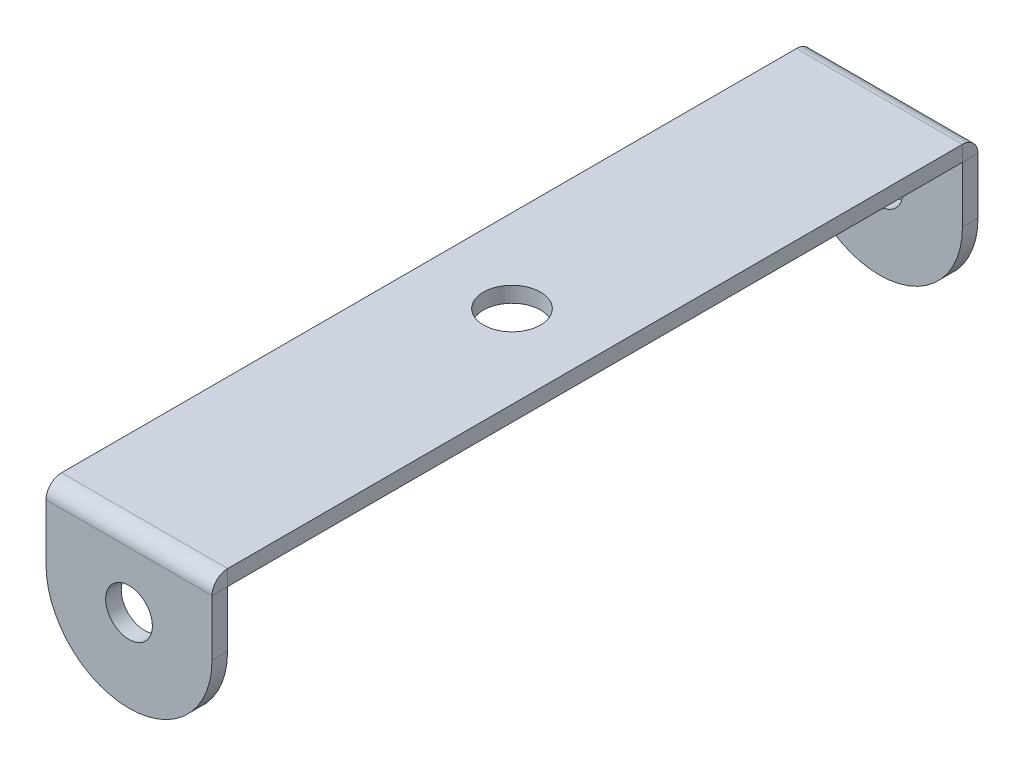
ISO-10303-21;
HEADER;
FILE_DESCRIPTION(('STEP AP214'),'2;1');
FILE_NAME('part.step','',(''),(''),'','','');
FILE_SCHEMA(('AUTOMOTIVE_DESIGN { 1 0 10303 214 1 1 1 1 }'));
ENDSEC;
DATA;
#1=APPLICATION_CONTEXT('core data for automotive mechanical design processes');
#2=APPLICATION_PROTOCOL_DEFINITION('international standard','automotive_design',2000,#1);
#3=PRODUCT_CONTEXT('',#1,'mechanical');
#4=PRODUCT('Part','Part','',(#3));
#5=PRODUCT_RELATED_PRODUCT_CATEGORY('part','',(#4));
#6=PRODUCT_DEFINITION_FORMATION('','',#4);
#7=PRODUCT_DEFINITION_CONTEXT('part definition',#1,'design');
#8=PRODUCT_DEFINITION('design','',#6,#7);
#9=PRODUCT_DEFINITION_SHAPE('','',#8);
#10=(LENGTH_UNIT() NAMED_UNIT(*) SI_UNIT(.MILLI.,.METRE.));
#11=(NAMED_UNIT(*) PLANE_ANGLE_UNIT() SI_UNIT($,.RADIAN.));
#12=(NAMED_UNIT(*) SI_UNIT($,.STERADIAN.) SOLID_ANGLE_UNIT());
#13=UNCERTAINTY_MEASURE_WITH_UNIT(LENGTH_MEASURE(1.E-05),#10,'distance_accuracy_value','');
#14=(GEOMETRIC_REPRESENTATION_CONTEXT(3) GLOBAL_UNCERTAINTY_ASSIGNED_CONTEXT((#13)) GLOBAL_UNIT_ASSIGNED_CONTEXT((#10,
#11,#12)) REPRESENTATION_CONTEXT('',''));
#15=CARTESIAN_POINT('',(0.,0.,0.));
#16=DIRECTION('',(0.,0.,1.));
#17=DIRECTION('',(1.,0.,0.));
#18=AXIS2_PLACEMENT_3D('',#15,#16,#17);
#19=CARTESIAN_POINT('',(0.,-1.5,-84.));
#20=DIRECTION('',(0.,1.,0.));
#21=DIRECTION('',(0.,0.,1.));
#22=AXIS2_PLACEMENT_3D('',#19,#20,#21);
#23=PLANE('',#22);
#24=CARTESIAN_POINT('',(0.,-1.5,-42.));
#25=DIRECTION('',(0.,1.,0.));
#26=DIRECTION('',(0.,0.,1.));
#27=AXIS2_PLACEMENT_3D('',#24,#25,#26);
#28=CIRCLE('',#27,2.75);
#29=CARTESIAN_POINT('',(0.,-1.5,-39.25));
#30=VERTEX_POINT('',#29);
#31=EDGE_CURVE('E244',#30,#30,#28,.T.);
#32=ORIENTED_EDGE('',*,*,#31,.T.);
#33=EDGE_LOOP('',(#32));
#34=FACE_BOUND('',#33,.T.);
#35=DIRECTION('',(0.,0.,1.));
#36=VECTOR('',#35,1.);
#37=CARTESIAN_POINT('',(-8.00000000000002,-1.5,-84.));
#38=LINE('',#37,#36);
#39=CARTESIAN_POINT('',(-8.00000000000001,-1.5,-77.4101659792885));
#40=VERTEX_POINT('',#39);
#41=CARTESIAN_POINT('',(-8.,-1.5,-6.58983402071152));
#42=VERTEX_POINT('',#41);
#43=EDGE_CURVE('E59',#40,#42,#38,.T.);
#44=ORIENTED_EDGE('',*,*,#43,.F.);
#45=DIRECTION('',(1.,0.,0.));
#46=VECTOR('',#45,1.);
#47=CARTESIAN_POINT('',(0.,-1.5,-77.4101659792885));
#48=LINE('',#47,#46);
#49=CARTESIAN_POINT('',(7.99999999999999,-1.5,-77.4101659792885));
#50=VERTEX_POINT('',#49);
#51=EDGE_CURVE('E259',#40,#50,#48,.T.);
#52=ORIENTED_EDGE('',*,*,#51,.T.);
#53=DIRECTION('',(0.,0.,-1.));
#54=VECTOR('',#53,1.);
#55=CARTESIAN_POINT('',(8.,-1.5,0.));
#56=LINE('',#55,#54);
#57=CARTESIAN_POINT('',(8.,-1.5,-6.58983402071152));
#58=VERTEX_POINT('',#57);
#59=EDGE_CURVE('E252',#58,#50,#56,.T.);
#60=ORIENTED_EDGE('',*,*,#59,.F.);
#61=DIRECTION('',(1.,0.,0.));
#62=VECTOR('',#61,1.);
#63=CARTESIAN_POINT('',(0.,-1.5,-6.58983402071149));
#64=LINE('',#63,#62);
#65=EDGE_CURVE('E249',#42,#58,#64,.T.);
#66=ORIENTED_EDGE('',*,*,#65,.F.);
#67=EDGE_LOOP('',(#44,#52,#60,#66));
#68=FACE_BOUND('',#67,.T.);
#69=ADVANCED_FACE('F55',(#34,#68),#23,.F.);
#70=CARTESIAN_POINT('',(8.,-1.5,0.));
#71=DIRECTION('',(1.,0.,0.));
#72=DIRECTION('',(0.,0.,-1.));
#73=AXIS2_PLACEMENT_3D('',#70,#71,#72);
#74=PLANE('',#73);
#75=DIRECTION('',(0.,-1.,0.));
#76=VECTOR('',#75,1.);
#77=CARTESIAN_POINT('',(7.99999999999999,-1.5,-77.4101659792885));
#78=LINE('',#77,#76);
#79=CARTESIAN_POINT('',(7.99999999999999,0.,-77.4101659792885));
#80=VERTEX_POINT('',#79);
#81=EDGE_CURVE('E14',#80,#50,#78,.T.);
#82=ORIENTED_EDGE('',*,*,#81,.F.);
#83=DIRECTION('',(0.,0.,-1.));
#84=VECTOR('',#83,1.);
#85=CARTESIAN_POINT('',(8.,0.,0.));
#86=LINE('',#85,#84);
#87=CARTESIAN_POINT('',(8.,0.,-6.58983402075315));
#88=VERTEX_POINT('',#87);
#89=EDGE_CURVE('E72',#88,#80,#86,.T.);
#90=ORIENTED_EDGE('',*,*,#89,.F.);
#91=DIRECTION('',(0.,-1.,0.));
#92=VECTOR('',#91,1.);
#93=CARTESIAN_POINT('',(8.,-1.5,-6.58983402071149));
#94=LINE('',#93,#92);
#95=EDGE_CURVE('E251',#88,#58,#94,.T.);
#96=ORIENTED_EDGE('',*,*,#95,.T.);
#97=ORIENTED_EDGE('',*,*,#59,.T.);
#98=EDGE_LOOP('',(#82,#90,#96,#97));
#99=FACE_BOUND('',#98,.T.);
#100=ADVANCED_FACE('F57',(#99),#74,.T.);
#101=CARTESIAN_POINT('',(-8.00000000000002,-1.5,-84.));
#102=DIRECTION('',(-1.,0.,0.));
#103=DIRECTION('',(0.,0.,1.));
#104=AXIS2_PLACEMENT_3D('',#101,#102,#103);
#105=PLANE('',#104);
#106=DIRECTION('',(0.,1.,0.));
#107=VECTOR('',#106,1.);
#108=CARTESIAN_POINT('',(-8.00000000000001,-1.5,-77.4101659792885));
#109=LINE('',#108,#107);
#110=CARTESIAN_POINT('',(-8.00000000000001,0.,-77.4101659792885));
#111=VERTEX_POINT('',#110);
#112=EDGE_CURVE('E262',#40,#111,#109,.T.);
#113=ORIENTED_EDGE('',*,*,#112,.F.);
#114=ORIENTED_EDGE('',*,*,#43,.T.);
#115=DIRECTION('',(0.,1.,0.));
#116=VECTOR('',#115,1.);
#117=CARTESIAN_POINT('',(-8.,-1.5,-6.58983402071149));
#118=LINE('',#117,#116);
#119=CARTESIAN_POINT('',(-8.,0.,-6.58983402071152));
#120=VERTEX_POINT('',#119);
#121=EDGE_CURVE('E257',#42,#120,#118,.T.);
#122=ORIENTED_EDGE('',*,*,#121,.T.);
#123=DIRECTION('',(0.,0.,1.));
#124=VECTOR('',#123,1.);
#125=CARTESIAN_POINT('',(-8.00000000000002,0.,-84.));
#126=LINE('',#125,#124);
#127=EDGE_CURVE('E80',#111,#120,#126,.T.);
#128=ORIENTED_EDGE('',*,*,#127,.F.);
#129=EDGE_LOOP('',(#113,#114,#122,#128));
#130=FACE_BOUND('',#129,.T.);
#131=ADVANCED_FACE('F272',(#130),#105,.T.);
#132=CARTESIAN_POINT('',(0.,0.,-84.));
#133=DIRECTION('',(0.,1.,0.));
#134=DIRECTION('',(0.,0.,1.));
#135=AXIS2_PLACEMENT_3D('',#132,#133,#134);
#136=PLANE('',#135);
#137=DIRECTION('',(1.,0.,0.));
#138=VECTOR('',#137,1.);
#139=CARTESIAN_POINT('',(0.,0.,-77.4101659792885));
#140=LINE('',#139,#138);
#141=EDGE_CURVE('E64',#111,#80,#140,.T.);
#142=ORIENTED_EDGE('',*,*,#141,.F.);
#143=ORIENTED_EDGE('',*,*,#127,.T.);
#144=DIRECTION('',(1.,0.,0.));
#145=VECTOR('',#144,1.);
#146=CARTESIAN_POINT('',(0.,0.,-6.58983402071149));
#147=LINE('',#146,#145);
#148=EDGE_CURVE('E255',#120,#88,#147,.T.);
#149=ORIENTED_EDGE('',*,*,#148,.T.);
#150=ORIENTED_EDGE('',*,*,#89,.T.);
#151=EDGE_LOOP('',(#142,#143,#149,#150));
#152=FACE_BOUND('',#151,.T.);
#153=CARTESIAN_POINT('',(0.,0.,-42.));
#154=DIRECTION('',(0.,1.,0.));
#155=DIRECTION('',(0.,0.,1.));
#156=AXIS2_PLACEMENT_3D('',#153,#154,#155);
#157=CIRCLE('',#156,2.75);
#158=CARTESIAN_POINT('',(0.,0.,-39.25));
#159=VERTEX_POINT('',#158);
#160=EDGE_CURVE('E240',#159,#159,#157,.T.);
#161=ORIENTED_EDGE('',*,*,#160,.F.);
#162=EDGE_LOOP('',(#161));
#163=FACE_BOUND('',#162,.T.);
#164=ADVANCED_FACE('F268',(#152,#163),#136,.T.);
#165=CARTESIAN_POINT('',(0.,-1.5,-42.));
#166=DIRECTION('',(0.,1.,0.));
#167=DIRECTION('',(0.,0.,1.));
#168=AXIS2_PLACEMENT_3D('',#165,#166,#167);
#169=CYLINDRICAL_SURFACE('',#168,2.75);
#170=ORIENTED_EDGE('',*,*,#31,.F.);
#171=EDGE_LOOP('',(#170));
#172=FACE_BOUND('',#171,.T.);
#173=ORIENTED_EDGE('',*,*,#160,.T.);
#174=EDGE_LOOP('',(#173));
#175=FACE_BOUND('',#174,.T.);
#176=ADVANCED_FACE('F333',(#172,#175),#169,.F.);
#177=CARTESIAN_POINT('',(-8.,-1.501,-6.58983402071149));
#178=DIRECTION('',(1.,0.,0.));
#179=DIRECTION('',(0.,0.,-1.));
#180=AXIS2_PLACEMENT_3D('',#177,#178,#179);
#181=PLANE('',#180);
#182=DIRECTION('',(0.,0.,1.));
#183=VECTOR('',#182,1.);
#184=CARTESIAN_POINT('',(-8.,-1.50100000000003,-6.58883402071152));
#185=LINE('',#184,#183);
#186=CARTESIAN_POINT('',(-8.,-1.501,-6.58883402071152));
#187=VERTEX_POINT('',#186);
#188=CARTESIAN_POINT('',(-8.,-1.501,-5.08883402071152));
#189=VERTEX_POINT('',#188);
#190=EDGE_CURVE('E191',#187,#189,#185,.T.);
#191=ORIENTED_EDGE('',*,*,#190,.T.);
#192=CARTESIAN_POINT('',(-8.,-1.501,-6.58983402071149));
#193=DIRECTION('',(-1.,0.,0.));
#194=DIRECTION('',(0.,0.,1.));
#195=AXIS2_PLACEMENT_3D('',#192,#193,#194);
#196=CIRCLE('',#195,1.501);
#197=EDGE_CURVE('E199',#189,#120,#196,.T.);
#198=ORIENTED_EDGE('',*,*,#197,.T.);
#199=ORIENTED_EDGE('',*,*,#121,.F.);
#200=CARTESIAN_POINT('',(-8.,-1.501,-6.58983402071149));
#201=DIRECTION('',(-1.,0.,0.));
#202=DIRECTION('',(0.,0.,-1.));
#203=AXIS2_PLACEMENT_3D('',#200,#201,#202);
#204=CIRCLE('',#203,0.00100000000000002);
#205=EDGE_CURVE('E233',#187,#42,#204,.T.);
#206=ORIENTED_EDGE('',*,*,#205,.F.);
#207=EDGE_LOOP('',(#191,#198,#199,#206));
#208=FACE_BOUND('',#207,.T.);
#209=ADVANCED_FACE('F276',(#208),#181,.F.);
#210=CARTESIAN_POINT('',(8.,-1.501,-6.58983402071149));
#211=DIRECTION('',(-1.,0.,0.));
#212=DIRECTION('',(0.,0.,1.));
#213=AXIS2_PLACEMENT_3D('',#210,#211,#212);
#214=PLANE('',#213);
#215=ORIENTED_EDGE('',*,*,#95,.F.);
#216=CARTESIAN_POINT('',(8.,-1.501,-6.58983402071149));
#217=DIRECTION('',(-1.,0.,0.));
#218=DIRECTION('',(0.,0.,1.));
#219=AXIS2_PLACEMENT_3D('',#216,#217,#218);
#220=CIRCLE('',#219,1.501);
#221=CARTESIAN_POINT('',(8.,-1.50100000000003,-5.08883402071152));
#222=VERTEX_POINT('',#221);
#223=EDGE_CURVE('E237',#88,#222,#220,.F.);
#224=ORIENTED_EDGE('',*,*,#223,.T.);
#225=DIRECTION('',(0.,0.,-1.));
#226=VECTOR('',#225,1.);
#227=CARTESIAN_POINT('',(8.,-1.50100000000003,-6.58883402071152));
#228=LINE('',#227,#226);
#229=CARTESIAN_POINT('',(8.,-1.501,-6.58883402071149));
#230=VERTEX_POINT('',#229);
#231=EDGE_CURVE('E225',#222,#230,#228,.T.);
#232=ORIENTED_EDGE('',*,*,#231,.T.);
#233=CARTESIAN_POINT('',(8.,-1.501,-6.58983402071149));
#234=DIRECTION('',(1.,0.,0.));
#235=DIRECTION('',(0.,0.,1.));
#236=AXIS2_PLACEMENT_3D('',#233,#234,#235);
#237=CIRCLE('',#236,0.00100000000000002);
#238=EDGE_CURVE('E236',#58,#230,#237,.T.);
#239=ORIENTED_EDGE('',*,*,#238,.F.);
#240=EDGE_LOOP('',(#215,#224,#232,#239));
#241=FACE_BOUND('',#240,.T.);
#242=ADVANCED_FACE('F289',(#241),#214,.F.);
#243=CARTESIAN_POINT('',(16.1133986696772,-1.501,-6.58983402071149));
#244=DIRECTION('',(-1.,0.,0.));
#245=DIRECTION('',(0.,0.,1.));
#246=AXIS2_PLACEMENT_3D('',#243,#244,#245);
#247=CYLINDRICAL_SURFACE('',#246,0.001);
#248=ORIENTED_EDGE('',*,*,#238,.T.);
#249=DIRECTION('',(1.,0.,0.));
#250=VECTOR('',#249,1.);
#251=CARTESIAN_POINT('',(0.,-1.50100000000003,-6.58883402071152));
#252=LINE('',#251,#250);
#253=EDGE_CURVE('E211',#187,#230,#252,.T.);
#254=ORIENTED_EDGE('',*,*,#253,.F.);
#255=ORIENTED_EDGE('',*,*,#205,.T.);
#256=ORIENTED_EDGE('',*,*,#65,.T.);
#257=EDGE_LOOP('',(#248,#254,#255,#256));
#258=FACE_BOUND('',#257,.T.);
#259=ADVANCED_FACE('F280',(#258),#247,.F.);
#260=CARTESIAN_POINT('',(16.1133986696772,-1.501,-6.58983402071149));
#261=DIRECTION('',(-1.,0.,0.));
#262=DIRECTION('',(0.,0.,1.));
#263=AXIS2_PLACEMENT_3D('',#260,#261,#262);
#264=CYLINDRICAL_SURFACE('',#263,1.501);
#265=ORIENTED_EDGE('',*,*,#223,.F.);
#266=ORIENTED_EDGE('',*,*,#148,.F.);
#267=ORIENTED_EDGE('',*,*,#197,.F.);
#268=DIRECTION('',(1.,0.,0.));
#269=VECTOR('',#268,1.);
#270=CARTESIAN_POINT('',(0.,-1.50100000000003,-5.08883402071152));
#271=LINE('',#270,#269);
#272=EDGE_CURVE('E228',#189,#222,#271,.T.);
#273=ORIENTED_EDGE('',*,*,#272,.T.);
#274=EDGE_LOOP('',(#265,#266,#267,#273));
#275=FACE_BOUND('',#274,.T.);
#276=ADVANCED_FACE('F303',(#275),#264,.T.);
#277=CARTESIAN_POINT('',(0.,-6.91116597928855,-6.58883402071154));
#278=DIRECTION('',(0.,0.,1.));
#279=DIRECTION('',(0.,-1.,0.));
#280=AXIS2_PLACEMENT_3D('',#277,#278,#279);
#281=CYLINDRICAL_SURFACE('',#280,8.);
#282=CARTESIAN_POINT('',(0.,-6.91116597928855,-5.08883402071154));
#283=DIRECTION('',(0.,0.,1.));
#284=DIRECTION('',(0.,-1.,0.));
#285=AXIS2_PLACEMENT_3D('',#282,#283,#284);
#286=CIRCLE('',#285,8.);
#287=CARTESIAN_POINT('',(-8.,-6.91116597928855,-5.08883402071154));
#288=VERTEX_POINT('',#287);
#289=CARTESIAN_POINT('',(8.,-6.91116597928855,-5.08883402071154));
#290=VERTEX_POINT('',#289);
#291=EDGE_CURVE('E204',#288,#290,#286,.T.);
#292=ORIENTED_EDGE('',*,*,#291,.F.);
#293=DIRECTION('',(0.,0.,1.));
#294=VECTOR('',#293,1.);
#295=CARTESIAN_POINT('',(-8.,-6.91116597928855,-6.58883402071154));
#296=LINE('',#295,#294);
#297=CARTESIAN_POINT('',(-8.,-6.91116597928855,-6.58883402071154));
#298=VERTEX_POINT('',#297);
#299=EDGE_CURVE('E196',#298,#288,#296,.T.);
#300=ORIENTED_EDGE('',*,*,#299,.F.);
#301=CARTESIAN_POINT('',(0.,-6.91116597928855,-6.58883402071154));
#302=DIRECTION('',(0.,0.,1.));
#303=DIRECTION('',(0.,-1.,0.));
#304=AXIS2_PLACEMENT_3D('',#301,#302,#303);
#305=CIRCLE('',#304,8.);
#306=CARTESIAN_POINT('',(8.,-6.91116597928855,-6.58883402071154));
#307=VERTEX_POINT('',#306);
#308=EDGE_CURVE('E222',#298,#307,#305,.T.);
#309=ORIENTED_EDGE('',*,*,#308,.T.);
#310=DIRECTION('',(0.,0.,1.));
#311=VECTOR('',#310,1.);
#312=CARTESIAN_POINT('',(8.,-6.91116597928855,-6.58883402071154));
#313=LINE('',#312,#311);
#314=EDGE_CURVE('E220',#307,#290,#313,.T.);
#315=ORIENTED_EDGE('',*,*,#314,.T.);
#316=EDGE_LOOP('',(#292,#300,#309,#315));
#317=FACE_BOUND('',#316,.T.);
#318=ADVANCED_FACE('F298',(#317),#281,.T.);
#319=CARTESIAN_POINT('',(0.,-6.91116597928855,-6.58883402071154));
#320=DIRECTION('',(0.,0.,1.));
#321=DIRECTION('',(0.,-1.,0.));
#322=AXIS2_PLACEMENT_3D('',#319,#320,#321);
#323=CYLINDRICAL_SURFACE('',#322,2.25);
#324=CARTESIAN_POINT('',(0.,-6.91116597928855,-6.58883402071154));
#325=DIRECTION('',(0.,0.,1.));
#326=DIRECTION('',(0.,-1.,0.));
#327=AXIS2_PLACEMENT_3D('',#324,#325,#326);
#328=CIRCLE('',#327,2.25);
#329=CARTESIAN_POINT('',(0.,-9.16116597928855,-6.58883402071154));
#330=VERTEX_POINT('',#329);
#331=EDGE_CURVE('E214',#330,#330,#328,.T.);
#332=ORIENTED_EDGE('',*,*,#331,.F.);
#333=EDGE_LOOP('',(#332));
#334=FACE_BOUND('',#333,.T.);
#335=CARTESIAN_POINT('',(0.,-6.91116597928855,-5.08883402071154));
#336=DIRECTION('',(0.,0.,1.));
#337=DIRECTION('',(0.,-1.,0.));
#338=AXIS2_PLACEMENT_3D('',#335,#336,#337);
#339=CIRCLE('',#338,2.25);
#340=CARTESIAN_POINT('',(0.,-9.16116597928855,-5.08883402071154));
#341=VERTEX_POINT('',#340);
#342=EDGE_CURVE('E217',#341,#341,#339,.T.);
#343=ORIENTED_EDGE('',*,*,#342,.T.);
#344=EDGE_LOOP('',(#343));
#345=FACE_BOUND('',#344,.T.);
#346=ADVANCED_FACE('F366',(#334,#345),#323,.F.);
#347=CARTESIAN_POINT('',(0.,77.0888340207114,-6.58883402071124));
#348=DIRECTION('',(0.,0.,1.));
#349=DIRECTION('',(0.,-1.,0.));
#350=AXIS2_PLACEMENT_3D('',#347,#348,#349);
#351=PLANE('',#350);
#352=ORIENTED_EDGE('',*,*,#331,.T.);
#353=EDGE_LOOP('',(#352));
#354=FACE_BOUND('',#353,.T.);
#355=DIRECTION('',(0.,-1.,0.));
#356=VECTOR('',#355,1.);
#357=CARTESIAN_POINT('',(-8.00000000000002,77.0888340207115,-6.58883402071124));
#358=LINE('',#357,#356);
#359=EDGE_CURVE('E200',#187,#298,#358,.T.);
#360=ORIENTED_EDGE('',*,*,#359,.F.);
#361=ORIENTED_EDGE('',*,*,#253,.T.);
#362=DIRECTION('',(0.,1.,0.));
#363=VECTOR('',#362,1.);
#364=CARTESIAN_POINT('',(8.,-6.91116597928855,-6.58883402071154));
#365=LINE('',#364,#363);
#366=EDGE_CURVE('E209',#307,#230,#365,.T.);
#367=ORIENTED_EDGE('',*,*,#366,.F.);
#368=ORIENTED_EDGE('',*,*,#308,.F.);
#369=EDGE_LOOP('',(#360,#361,#367,#368));
#370=FACE_BOUND('',#369,.T.);
#371=ADVANCED_FACE('F284',(#354,#370),#351,.F.);
#372=CARTESIAN_POINT('',(8.,-6.91116597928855,-6.58883402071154));
#373=DIRECTION('',(1.,0.,0.));
#374=DIRECTION('',(0.,1.,0.));
#375=AXIS2_PLACEMENT_3D('',#372,#373,#374);
#376=PLANE('',#375);
#377=ORIENTED_EDGE('',*,*,#231,.F.);
#378=DIRECTION('',(0.,1.,0.));
#379=VECTOR('',#378,1.);
#380=CARTESIAN_POINT('',(8.,-6.91116597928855,-5.08883402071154));
#381=LINE('',#380,#379);
#382=EDGE_CURVE('E202',#290,#222,#381,.T.);
#383=ORIENTED_EDGE('',*,*,#382,.F.);
#384=ORIENTED_EDGE('',*,*,#314,.F.);
#385=ORIENTED_EDGE('',*,*,#366,.T.);
#386=EDGE_LOOP('',(#377,#383,#384,#385));
#387=FACE_BOUND('',#386,.T.);
#388=ADVANCED_FACE('F294',(#387),#376,.T.);
#389=CARTESIAN_POINT('',(0.,77.0888340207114,-5.08883402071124));
#390=DIRECTION('',(0.,0.,1.));
#391=DIRECTION('',(0.,-1.,0.));
#392=AXIS2_PLACEMENT_3D('',#389,#390,#391);
#393=PLANE('',#392);
#394=ORIENTED_EDGE('',*,*,#272,.F.);
#395=DIRECTION('',(0.,-1.,0.));
#396=VECTOR('',#395,1.);
#397=CARTESIAN_POINT('',(-8.00000000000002,77.0888340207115,-5.08883402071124));
#398=LINE('',#397,#396);
#399=EDGE_CURVE('E207',#189,#288,#398,.T.);
#400=ORIENTED_EDGE('',*,*,#399,.T.);
#401=ORIENTED_EDGE('',*,*,#291,.T.);
#402=ORIENTED_EDGE('',*,*,#382,.T.);
#403=EDGE_LOOP('',(#394,#400,#401,#402));
#404=FACE_BOUND('',#403,.T.);
#405=ORIENTED_EDGE('',*,*,#342,.F.);
#406=EDGE_LOOP('',(#405));
#407=FACE_BOUND('',#406,.T.);
#408=ADVANCED_FACE('F358',(#404,#407),#393,.T.);
#409=CARTESIAN_POINT('',(-8.00000000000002,77.0888340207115,-6.58883402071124));
#410=DIRECTION('',(-1.,0.,0.));
#411=DIRECTION('',(0.,-1.,0.));
#412=AXIS2_PLACEMENT_3D('',#409,#410,#411);
#413=PLANE('',#412);
#414=ORIENTED_EDGE('',*,*,#190,.F.);
#415=ORIENTED_EDGE('',*,*,#359,.T.);
#416=ORIENTED_EDGE('',*,*,#299,.T.);
#417=ORIENTED_EDGE('',*,*,#399,.F.);
#418=EDGE_LOOP('',(#414,#415,#416,#417));
#419=FACE_BOUND('',#418,.T.);
#420=ADVANCED_FACE('F300',(#419),#413,.T.);
#421=CARTESIAN_POINT('',(-8.00000000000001,-1.501,-77.4101659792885));
#422=DIRECTION('',(1.,0.,0.));
#423=DIRECTION('',(0.,0.,-1.));
#424=AXIS2_PLACEMENT_3D('',#421,#422,#423);
#425=PLANE('',#424);
#426=ORIENTED_EDGE('',*,*,#112,.T.);
#427=CARTESIAN_POINT('',(-8.00000000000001,-1.501,-77.4101659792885));
#428=DIRECTION('',(1.,0.,0.));
#429=DIRECTION('',(0.,0.,-1.));
#430=AXIS2_PLACEMENT_3D('',#427,#428,#429);
#431=CIRCLE('',#430,1.501);
#432=CARTESIAN_POINT('',(-8.00000000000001,-1.50100000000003,-78.9111659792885));
#433=VERTEX_POINT('',#432);
#434=EDGE_CURVE('E166',#111,#433,#431,.F.);
#435=ORIENTED_EDGE('',*,*,#434,.T.);
#436=DIRECTION('',(0.,0.,-1.));
#437=VECTOR('',#436,1.);
#438=CARTESIAN_POINT('',(-8.00000000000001,-1.50100000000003,-77.4111659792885));
#439=LINE('',#438,#437);
#440=CARTESIAN_POINT('',(-8.00000000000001,-1.50100000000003,-77.4111659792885));
#441=VERTEX_POINT('',#440);
#442=EDGE_CURVE('E320',#441,#433,#439,.T.);
#443=ORIENTED_EDGE('',*,*,#442,.F.);
#444=CARTESIAN_POINT('',(-8.00000000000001,-1.501,-77.4101659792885));
#445=DIRECTION('',(-1.,0.,0.));
#446=DIRECTION('',(0.,0.,-1.));
#447=AXIS2_PLACEMENT_3D('',#444,#445,#446);
#448=CIRCLE('',#447,0.00100000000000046);
#449=EDGE_CURVE('E184',#40,#441,#448,.T.);
#450=ORIENTED_EDGE('',*,*,#449,.F.);
#451=EDGE_LOOP('',(#426,#435,#443,#450));
#452=FACE_BOUND('',#451,.T.);
#453=ADVANCED_FACE('F317',(#452),#425,.F.);
#454=CARTESIAN_POINT('',(7.99999999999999,-1.501,-77.4101659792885));
#455=DIRECTION('',(-1.,0.,0.));
#456=DIRECTION('',(0.,0.,1.));
#457=AXIS2_PLACEMENT_3D('',#454,#455,#456);
#458=PLANE('',#457);
#459=DIRECTION('',(0.,0.,1.));
#460=VECTOR('',#459,1.);
#461=CARTESIAN_POINT('',(7.99999999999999,-1.50100000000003,-77.4111659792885));
#462=LINE('',#461,#460);
#463=CARTESIAN_POINT('',(7.99999999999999,-1.501,-78.9111659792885));
#464=VERTEX_POINT('',#463);
#465=CARTESIAN_POINT('',(7.99999999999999,-1.501,-77.4111659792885));
#466=VERTEX_POINT('',#465);
#467=EDGE_CURVE('E155',#464,#466,#462,.T.);
#468=ORIENTED_EDGE('',*,*,#467,.F.);
#469=CARTESIAN_POINT('',(7.99999999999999,-1.501,-77.4101659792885));
#470=DIRECTION('',(1.,0.,0.));
#471=DIRECTION('',(0.,0.,-1.));
#472=AXIS2_PLACEMENT_3D('',#469,#470,#471);
#473=CIRCLE('',#472,1.501);
#474=EDGE_CURVE('E188',#464,#80,#473,.T.);
#475=ORIENTED_EDGE('',*,*,#474,.T.);
#476=ORIENTED_EDGE('',*,*,#81,.T.);
#477=CARTESIAN_POINT('',(7.99999999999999,-1.501,-77.4101659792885));
#478=DIRECTION('',(1.,0.,0.));
#479=DIRECTION('',(0.,0.,1.));
#480=AXIS2_PLACEMENT_3D('',#477,#478,#479);
#481=CIRCLE('',#480,0.00100000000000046);
#482=EDGE_CURVE('E187',#466,#50,#481,.T.);
#483=ORIENTED_EDGE('',*,*,#482,.F.);
#484=EDGE_LOOP('',(#468,#475,#476,#483));
#485=FACE_BOUND('',#484,.T.);
#486=ADVANCED_FACE('F308',(#485),#458,.F.);
#487=CARTESIAN_POINT('',(-16.1133986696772,-1.501,-77.4101659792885));
#488=DIRECTION('',(1.,0.,0.));
#489=DIRECTION('',(0.,0.,-1.));
#490=AXIS2_PLACEMENT_3D('',#487,#488,#489);
#491=CYLINDRICAL_SURFACE('',#490,0.001);
#492=ORIENTED_EDGE('',*,*,#482,.T.);
#493=ORIENTED_EDGE('',*,*,#51,.F.);
#494=ORIENTED_EDGE('',*,*,#449,.T.);
#495=DIRECTION('',(1.,0.,0.));
#496=VECTOR('',#495,1.);
#497=CARTESIAN_POINT('',(0.,-1.50100000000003,-77.4111659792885));
#498=LINE('',#497,#496);
#499=EDGE_CURVE('E179',#441,#466,#498,.T.);
#500=ORIENTED_EDGE('',*,*,#499,.T.);
#501=EDGE_LOOP('',(#492,#493,#494,#500));
#502=FACE_BOUND('',#501,.T.);
#503=ADVANCED_FACE('F323',(#502),#491,.F.);
#504=CARTESIAN_POINT('',(-16.1133986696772,-1.501,-77.4101659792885));
#505=DIRECTION('',(1.,0.,0.));
#506=DIRECTION('',(0.,0.,-1.));
#507=AXIS2_PLACEMENT_3D('',#504,#505,#506);
#508=CYLINDRICAL_SURFACE('',#507,1.501);
#509=ORIENTED_EDGE('',*,*,#474,.F.);
#510=DIRECTION('',(1.,0.,0.));
#511=VECTOR('',#510,1.);
#512=CARTESIAN_POINT('',(0.,-1.50100000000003,-78.9111659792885));
#513=LINE('',#512,#511);
#514=EDGE_CURVE('E314',#433,#464,#513,.T.);
#515=ORIENTED_EDGE('',*,*,#514,.F.);
#516=ORIENTED_EDGE('',*,*,#434,.F.);
#517=ORIENTED_EDGE('',*,*,#141,.T.);
#518=EDGE_LOOP('',(#509,#515,#516,#517));
#519=FACE_BOUND('',#518,.T.);
#520=ADVANCED_FACE('F312',(#519),#508,.T.);
#521=CARTESIAN_POINT('',(0.,-6.91116597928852,-77.4111659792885));
#522=DIRECTION('',(0.,0.,-1.));
#523=DIRECTION('',(0.,1.,0.));
#524=AXIS2_PLACEMENT_3D('',#521,#522,#523);
#525=CYLINDRICAL_SURFACE('',#524,2.25);
#526=CARTESIAN_POINT('',(0.,-6.91116597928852,-77.4111659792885));
#527=DIRECTION('',(0.,0.,-1.));
#528=DIRECTION('',(0.,1.,0.));
#529=AXIS2_PLACEMENT_3D('',#526,#527,#528);
#530=CIRCLE('',#529,2.25);
#531=CARTESIAN_POINT('',(0.,-4.66116597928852,-77.4111659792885));
#532=VERTEX_POINT('',#531);
#533=EDGE_CURVE('E176',#532,#532,#530,.T.);
#534=ORIENTED_EDGE('',*,*,#533,.F.);
#535=EDGE_LOOP('',(#534));
#536=FACE_BOUND('',#535,.T.);
#537=CARTESIAN_POINT('',(0.,-6.91116597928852,-78.9111659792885));
#538=DIRECTION('',(0.,0.,-1.));
#539=DIRECTION('',(0.,1.,0.));
#540=AXIS2_PLACEMENT_3D('',#537,#538,#539);
#541=CIRCLE('',#540,2.25);
#542=CARTESIAN_POINT('',(0.,-4.66116597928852,-78.9111659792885));
#543=VERTEX_POINT('',#542);
#544=EDGE_CURVE('E174',#543,#543,#541,.T.);
#545=ORIENTED_EDGE('',*,*,#544,.T.);
#546=EDGE_LOOP('',(#545));
#547=FACE_BOUND('',#546,.T.);
#548=ADVANCED_FACE('F379',(#536,#547),#525,.F.);
#549=CARTESIAN_POINT('',(0.,-6.91116597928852,-77.4111659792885));
#550=DIRECTION('',(0.,0.,-1.));
#551=DIRECTION('',(0.,1.,0.));
#552=AXIS2_PLACEMENT_3D('',#549,#550,#551);
#553=CYLINDRICAL_SURFACE('',#552,8.);
#554=CARTESIAN_POINT('',(0.,-6.91116597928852,-78.9111659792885));
#555=DIRECTION('',(0.,0.,-1.));
#556=DIRECTION('',(0.,1.,0.));
#557=AXIS2_PLACEMENT_3D('',#554,#555,#556);
#558=CIRCLE('',#557,8.);
#559=CARTESIAN_POINT('',(7.99999999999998,-6.91116597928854,-78.9111659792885));
#560=VERTEX_POINT('',#559);
#561=CARTESIAN_POINT('',(-8.00000000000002,-6.91116597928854,-78.9111659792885));
#562=VERTEX_POINT('',#561);
#563=EDGE_CURVE('E165',#560,#562,#558,.T.);
#564=ORIENTED_EDGE('',*,*,#563,.F.);
#565=DIRECTION('',(0.,0.,-1.));
#566=VECTOR('',#565,1.);
#567=CARTESIAN_POINT('',(7.99999999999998,-6.91116597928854,-77.4111659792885));
#568=LINE('',#567,#566);
#569=CARTESIAN_POINT('',(7.99999999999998,-6.91116597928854,-77.4111659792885));
#570=VERTEX_POINT('',#569);
#571=EDGE_CURVE('E152',#570,#560,#568,.T.);
#572=ORIENTED_EDGE('',*,*,#571,.F.);
#573=CARTESIAN_POINT('',(0.,-6.91116597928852,-77.4111659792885));
#574=DIRECTION('',(0.,0.,-1.));
#575=DIRECTION('',(0.,1.,0.));
#576=AXIS2_PLACEMENT_3D('',#573,#574,#575);
#577=CIRCLE('',#576,8.);
#578=CARTESIAN_POINT('',(-8.00000000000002,-6.91116597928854,-77.4111659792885));
#579=VERTEX_POINT('',#578);
#580=EDGE_CURVE('E163',#570,#579,#577,.T.);
#581=ORIENTED_EDGE('',*,*,#580,.T.);
#582=DIRECTION('',(0.,0.,-1.));
#583=VECTOR('',#582,1.);
#584=CARTESIAN_POINT('',(-8.00000000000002,-6.91116597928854,-77.4111659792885));
#585=LINE('',#584,#583);
#586=EDGE_CURVE('E173',#579,#562,#585,.T.);
#587=ORIENTED_EDGE('',*,*,#586,.T.);
#588=EDGE_LOOP('',(#564,#572,#581,#587));
#589=FACE_BOUND('',#588,.T.);
#590=ADVANCED_FACE('F162',(#589),#553,.T.);
#591=CARTESIAN_POINT('',(0.,-6.91116597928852,-77.4111659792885));
#592=DIRECTION('',(0.,0.,-1.));
#593=DIRECTION('',(0.,1.,0.));
#594=AXIS2_PLACEMENT_3D('',#591,#592,#593);
#595=PLANE('',#594);
#596=ORIENTED_EDGE('',*,*,#499,.F.);
#597=DIRECTION('',(0.,1.,0.));
#598=VECTOR('',#597,1.);
#599=CARTESIAN_POINT('',(-8.00000000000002,-6.91116597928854,-77.4111659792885));
#600=LINE('',#599,#598);
#601=EDGE_CURVE('E172',#579,#441,#600,.T.);
#602=ORIENTED_EDGE('',*,*,#601,.F.);
#603=ORIENTED_EDGE('',*,*,#580,.F.);
#604=DIRECTION('',(0.,-1.,0.));
#605=VECTOR('',#604,1.);
#606=CARTESIAN_POINT('',(8.,77.0888340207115,-77.4111659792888));
#607=LINE('',#606,#605);
#608=EDGE_CURVE('E149',#466,#570,#607,.T.);
#609=ORIENTED_EDGE('',*,*,#608,.F.);
#610=EDGE_LOOP('',(#596,#602,#603,#609));
#611=FACE_BOUND('',#610,.T.);
#612=ORIENTED_EDGE('',*,*,#533,.T.);
#613=EDGE_LOOP('',(#612));
#614=FACE_BOUND('',#613,.T.);
#615=ADVANCED_FACE('F169',(#611,#614),#595,.F.);
#616=CARTESIAN_POINT('',(-8.00000000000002,-6.91116597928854,-77.4111659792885));
#617=DIRECTION('',(-1.,0.,0.));
#618=DIRECTION('',(0.,1.,0.));
#619=AXIS2_PLACEMENT_3D('',#616,#617,#618);
#620=PLANE('',#619);
#621=ORIENTED_EDGE('',*,*,#601,.T.);
#622=ORIENTED_EDGE('',*,*,#442,.T.);
#623=DIRECTION('',(0.,1.,0.));
#624=VECTOR('',#623,1.);
#625=CARTESIAN_POINT('',(-8.00000000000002,-6.91116597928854,-78.9111659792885));
#626=LINE('',#625,#624);
#627=EDGE_CURVE('E406',#562,#433,#626,.T.);
#628=ORIENTED_EDGE('',*,*,#627,.F.);
#629=ORIENTED_EDGE('',*,*,#586,.F.);
#630=EDGE_LOOP('',(#621,#622,#628,#629));
#631=FACE_BOUND('',#630,.T.);
#632=ADVANCED_FACE('F387',(#631),#620,.T.);
#633=CARTESIAN_POINT('',(0.,-6.91116597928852,-78.9111659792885));
#634=DIRECTION('',(0.,0.,-1.));
#635=DIRECTION('',(0.,1.,0.));
#636=AXIS2_PLACEMENT_3D('',#633,#634,#635);
#637=PLANE('',#636);
#638=ORIENTED_EDGE('',*,*,#544,.F.);
#639=EDGE_LOOP('',(#638));
#640=FACE_BOUND('',#639,.T.);
#641=ORIENTED_EDGE('',*,*,#627,.T.);
#642=ORIENTED_EDGE('',*,*,#514,.T.);
#643=DIRECTION('',(0.,-1.,0.));
#644=VECTOR('',#643,1.);
#645=CARTESIAN_POINT('',(8.,77.0888340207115,-78.9111659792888));
#646=LINE('',#645,#644);
#647=EDGE_CURVE('E412',#464,#560,#646,.T.);
#648=ORIENTED_EDGE('',*,*,#647,.T.);
#649=ORIENTED_EDGE('',*,*,#563,.T.);
#650=EDGE_LOOP('',(#641,#642,#648,#649));
#651=FACE_BOUND('',#650,.T.);
#652=ADVANCED_FACE('F384',(#640,#651),#637,.T.);
#653=CARTESIAN_POINT('',(8.,77.0888340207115,-77.4111659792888));
#654=DIRECTION('',(1.,0.,0.));
#655=DIRECTION('',(0.,-1.,0.));
#656=AXIS2_PLACEMENT_3D('',#653,#654,#655);
#657=PLANE('',#656);
#658=ORIENTED_EDGE('',*,*,#647,.F.);
#659=ORIENTED_EDGE('',*,*,#467,.T.);
#660=ORIENTED_EDGE('',*,*,#608,.T.);
#661=ORIENTED_EDGE('',*,*,#571,.T.);
#662=EDGE_LOOP('',(#658,#659,#660,#661));
#663=FACE_BOUND('',#662,.T.);
#664=ADVANCED_FACE('F151',(#663),#657,.T.);
#665=CLOSED_SHELL('',(#69,#100,#131,#164,#176,#209,#242,#259,#276,#318,#346,#371,#388,#408,#420,
#453,#486,#503,#520,#548,#590,#615,#632,#652,#664));
#666=MANIFOLD_SOLID_BREP('B2',#665);
#667=ADVANCED_BREP_SHAPE_REPRESENTATION('',(#18,#666),#14);
#668=SHAPE_DEFINITION_REPRESENTATION(#9,#667);
ENDSEC;
END-ISO-10303-21;
